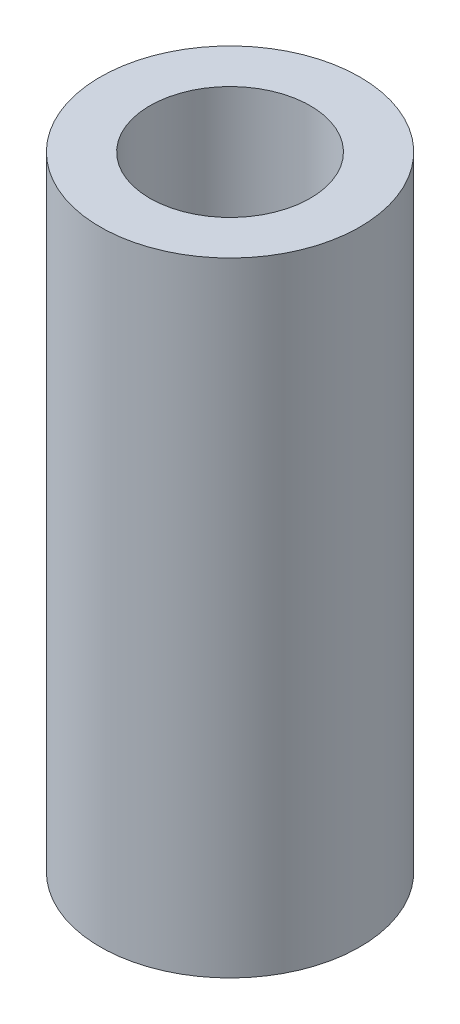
from build123d import *

# Parameters (mm, degrees)
SKETCH1_R                                      = 7.9375
EXTRUDE1_DEPTH                                 = 38.1
SKETCH2_R                                      = 4.9022
CAVITY_DEPTH                                   = 31.75
CSK_FOR_8_FLAT_HEAD_MACHINE_SCREW1_D           = 4.4958
CSK_FOR_8_FLAT_HEAD_MACHINE_SCREW1_CSINK_D     = 8.4328
CSK_FOR_8_FLAT_HEAD_MACHINE_SCREW1_CSINK_ANGLE = 82


with BuildPart() as part:
    # Sketch1 → Extrude1 (new body)
    with BuildSketch(Plane(origin=(0, 0, 0), x_dir=(1, 0, 0), z_dir=(0, 1, 0))):
        with Locations(Location((0, 0, 0), (0, 0, 90))):
            Circle(SKETCH1_R)
    extrude(amount=EXTRUDE1_DEPTH)

    # Sketch2 → cavity (cut)
    with BuildSketch(Plane(origin=(0, 38.1, 0), x_dir=(-1, 0, 0), z_dir=(0, 1, 0))):
        with Locations(Location((0, 0, 0), (0, 0, 90))):
            Circle(SKETCH2_R)
    extrude(amount=-CAVITY_DEPTH, mode=Mode.SUBTRACT)

    # CSK for _8 Flat Head Machine Screw1 (through all)
    with Locations(Plane(origin=(0, 6.35, 0), x_dir=(-1, 0, 0), z_dir=(0, 1, 0))):
        with Locations((0, 0)):
            CounterSinkHole(CSK_FOR_8_FLAT_HEAD_MACHINE_SCREW1_D / 2, CSK_FOR_8_FLAT_HEAD_MACHINE_SCREW1_CSINK_D / 2, counter_sink_angle=CSK_FOR_8_FLAT_HEAD_MACHINE_SCREW1_CSINK_ANGLE)


solid = part.part
